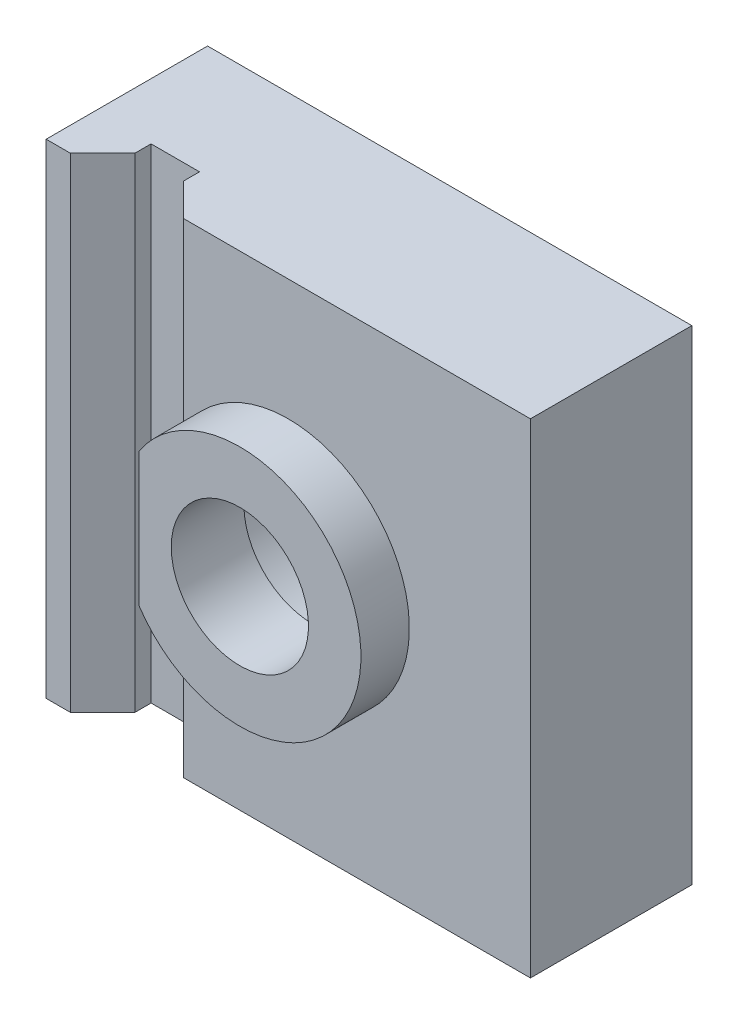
ISO-10303-21;
HEADER;
FILE_DESCRIPTION(('STEP AP214'),'2;1');
FILE_NAME('part.step','',(''),(''),'','','');
FILE_SCHEMA(('AUTOMOTIVE_DESIGN { 1 0 10303 214 1 1 1 1 }'));
ENDSEC;
DATA;
#1=APPLICATION_CONTEXT('core data for automotive mechanical design processes');
#2=APPLICATION_PROTOCOL_DEFINITION('international standard','automotive_design',2000,#1);
#3=PRODUCT_CONTEXT('',#1,'mechanical');
#4=PRODUCT('Part','Part','',(#3));
#5=PRODUCT_RELATED_PRODUCT_CATEGORY('part','',(#4));
#6=PRODUCT_DEFINITION_FORMATION('','',#4);
#7=PRODUCT_DEFINITION_CONTEXT('part definition',#1,'design');
#8=PRODUCT_DEFINITION('design','',#6,#7);
#9=PRODUCT_DEFINITION_SHAPE('','',#8);
#10=(LENGTH_UNIT() NAMED_UNIT(*) SI_UNIT(.MILLI.,.METRE.));
#11=(NAMED_UNIT(*) PLANE_ANGLE_UNIT() SI_UNIT($,.RADIAN.));
#12=(NAMED_UNIT(*) SI_UNIT($,.STERADIAN.) SOLID_ANGLE_UNIT());
#13=UNCERTAINTY_MEASURE_WITH_UNIT(LENGTH_MEASURE(1.E-05),#10,'distance_accuracy_value','');
#14=(GEOMETRIC_REPRESENTATION_CONTEXT(3) GLOBAL_UNCERTAINTY_ASSIGNED_CONTEXT((#13)) GLOBAL_UNIT_ASSIGNED_CONTEXT((#10,
#11,#12)) REPRESENTATION_CONTEXT('',''));
#15=CARTESIAN_POINT('',(0.,0.,0.));
#16=DIRECTION('',(0.,0.,1.));
#17=DIRECTION('',(1.,0.,0.));
#18=AXIS2_PLACEMENT_3D('',#15,#16,#17);
#19=CARTESIAN_POINT('',(0.,0.,10.));
#20=DIRECTION('',(0.,0.,1.));
#21=DIRECTION('',(1.,0.,0.));
#22=AXIS2_PLACEMENT_3D('',#19,#20,#21);
#23=PLANE('',#22);
#24=DIRECTION('',(0.,1.,0.));
#25=VECTOR('',#24,1.);
#26=CARTESIAN_POINT('',(-13.5,-15.,10.));
#27=LINE('',#26,#25);
#28=CARTESIAN_POINT('',(-13.5,-15.,10.));
#29=VERTEX_POINT('',#28);
#30=CARTESIAN_POINT('',(-13.5,15.,10.));
#31=VERTEX_POINT('',#30);
#32=EDGE_CURVE('E210',#29,#31,#27,.T.);
#33=ORIENTED_EDGE('',*,*,#32,.T.);
#34=DIRECTION('',(-1.,0.,0.));
#35=VECTOR('',#34,1.);
#36=CARTESIAN_POINT('',(-15.,15.,10.));
#37=LINE('',#36,#35);
#38=CARTESIAN_POINT('',(-15.,15.,10.));
#39=VERTEX_POINT('',#38);
#40=EDGE_CURVE('E185',#31,#39,#37,.T.);
#41=ORIENTED_EDGE('',*,*,#40,.T.);
#42=DIRECTION('',(0.,-1.,0.));
#43=VECTOR('',#42,1.);
#44=CARTESIAN_POINT('',(-15.,15.,10.));
#45=LINE('',#44,#43);
#46=CARTESIAN_POINT('',(-15.,-15.,10.));
#47=VERTEX_POINT('',#46);
#48=EDGE_CURVE('E149',#39,#47,#45,.T.);
#49=ORIENTED_EDGE('',*,*,#48,.T.);
#50=DIRECTION('',(1.,0.,0.));
#51=VECTOR('',#50,1.);
#52=CARTESIAN_POINT('',(-15.,-15.,10.));
#53=LINE('',#52,#51);
#54=EDGE_CURVE('E148',#47,#29,#53,.T.);
#55=ORIENTED_EDGE('',*,*,#54,.T.);
#56=EDGE_LOOP('',(#33,#41,#49,#55));
#57=FACE_BOUND('',#56,.T.);
#58=ADVANCED_FACE('F32',(#57),#23,.T.);
#59=DIRECTION('',(0.,1.,0.));
#60=VECTOR('',#59,1.);
#61=CARTESIAN_POINT('',(-6.5,-15.,10.));
#62=LINE('',#61,#60);
#63=CARTESIAN_POINT('',(-6.5,-15.,10.));
#64=VERTEX_POINT('',#63);
#65=CARTESIAN_POINT('',(-6.5,15.,10.));
#66=VERTEX_POINT('',#65);
#67=EDGE_CURVE('E126',#64,#66,#62,.T.);
#68=ORIENTED_EDGE('',*,*,#67,.F.);
#69=CARTESIAN_POINT('',(15.,-15.,10.));
#70=VERTEX_POINT('',#69);
#71=EDGE_CURVE('E138',#64,#70,#53,.T.);
#72=ORIENTED_EDGE('',*,*,#71,.T.);
#73=DIRECTION('',(0.,1.,0.));
#74=VECTOR('',#73,1.);
#75=CARTESIAN_POINT('',(15.,15.,10.));
#76=LINE('',#75,#74);
#77=CARTESIAN_POINT('',(15.,15.,10.));
#78=VERTEX_POINT('',#77);
#79=EDGE_CURVE('E165',#70,#78,#76,.T.);
#80=ORIENTED_EDGE('',*,*,#79,.T.);
#81=EDGE_CURVE('E140',#78,#66,#37,.T.);
#82=ORIENTED_EDGE('',*,*,#81,.T.);
#83=EDGE_LOOP('',(#68,#72,#80,#82));
#84=FACE_BOUND('',#83,.T.);
#85=DIRECTION('',(0.,-1.,0.));
#86=VECTOR('',#85,1.);
#87=CARTESIAN_POINT('',(-6.25,-4.14578098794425,10.));
#88=LINE('',#87,#86);
#89=CARTESIAN_POINT('',(-6.25,4.14578098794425,10.));
#90=VERTEX_POINT('',#89);
#91=CARTESIAN_POINT('',(-6.25,-4.14578098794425,10.));
#92=VERTEX_POINT('',#91);
#93=EDGE_CURVE('E192',#90,#92,#88,.T.);
#94=ORIENTED_EDGE('',*,*,#93,.F.);
#95=CARTESIAN_POINT('',(0.,0.,10.));
#96=DIRECTION('',(0.,0.,1.));
#97=DIRECTION('',(1.,0.,0.));
#98=AXIS2_PLACEMENT_3D('',#95,#96,#97);
#99=CIRCLE('',#98,7.5);
#100=EDGE_CURVE('E55',#92,#90,#99,.T.);
#101=ORIENTED_EDGE('',*,*,#100,.F.);
#102=EDGE_LOOP('',(#94,#101));
#103=FACE_BOUND('',#102,.T.);
#104=ADVANCED_FACE('F135',(#84,#103),#23,.T.);
#105=CARTESIAN_POINT('',(15.,15.,10.));
#106=DIRECTION('',(-1.,0.,0.));
#107=DIRECTION('',(0.,-1.,0.));
#108=AXIS2_PLACEMENT_3D('',#105,#106,#107);
#109=PLANE('',#108);
#110=DIRECTION('',(0.,1.,0.));
#111=VECTOR('',#110,1.);
#112=CARTESIAN_POINT('',(15.,15.,0.));
#113=LINE('',#112,#111);
#114=CARTESIAN_POINT('',(15.,-15.,0.));
#115=VERTEX_POINT('',#114);
#116=CARTESIAN_POINT('',(15.,15.,0.));
#117=VERTEX_POINT('',#116);
#118=EDGE_CURVE('E155',#115,#117,#113,.T.);
#119=ORIENTED_EDGE('',*,*,#118,.T.);
#120=DIRECTION('',(0.,0.,-1.));
#121=VECTOR('',#120,1.);
#122=CARTESIAN_POINT('',(15.,15.,10.));
#123=LINE('',#122,#121);
#124=EDGE_CURVE('E11',#78,#117,#123,.T.);
#125=ORIENTED_EDGE('',*,*,#124,.F.);
#126=ORIENTED_EDGE('',*,*,#79,.F.);
#127=DIRECTION('',(0.,0.,-1.));
#128=VECTOR('',#127,1.);
#129=CARTESIAN_POINT('',(15.,-15.,10.));
#130=LINE('',#129,#128);
#131=EDGE_CURVE('E146',#70,#115,#130,.T.);
#132=ORIENTED_EDGE('',*,*,#131,.T.);
#133=EDGE_LOOP('',(#119,#125,#126,#132));
#134=FACE_BOUND('',#133,.T.);
#135=ADVANCED_FACE('F34',(#134),#109,.F.);
#136=CARTESIAN_POINT('',(-15.,15.,10.));
#137=DIRECTION('',(0.,-1.,0.));
#138=DIRECTION('',(0.,0.,-1.));
#139=AXIS2_PLACEMENT_3D('',#136,#137,#138);
#140=PLANE('',#139);
#141=ORIENTED_EDGE('',*,*,#40,.F.);
#142=DIRECTION('',(-0.707106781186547,0.,0.707106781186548));
#143=VECTOR('',#142,1.);
#144=CARTESIAN_POINT('',(-13.5,15.,10.));
#145=LINE('',#144,#143);
#146=CARTESIAN_POINT('',(-11.5,15.,8.));
#147=VERTEX_POINT('',#146);
#148=EDGE_CURVE('E131',#147,#31,#145,.T.);
#149=ORIENTED_EDGE('',*,*,#148,.F.);
#150=DIRECTION('',(0.,0.,1.));
#151=VECTOR('',#150,1.);
#152=CARTESIAN_POINT('',(-11.5,15.,8.));
#153=LINE('',#152,#151);
#154=CARTESIAN_POINT('',(-11.5,15.,7.));
#155=VERTEX_POINT('',#154);
#156=EDGE_CURVE('E222',#155,#147,#153,.T.);
#157=ORIENTED_EDGE('',*,*,#156,.F.);
#158=DIRECTION('',(-1.,0.,0.));
#159=VECTOR('',#158,1.);
#160=CARTESIAN_POINT('',(-11.5,15.,7.));
#161=LINE('',#160,#159);
#162=CARTESIAN_POINT('',(-8.5,15.,7.));
#163=VERTEX_POINT('',#162);
#164=EDGE_CURVE('E225',#163,#155,#161,.T.);
#165=ORIENTED_EDGE('',*,*,#164,.F.);
#166=DIRECTION('',(0.,0.,-1.));
#167=VECTOR('',#166,1.);
#168=CARTESIAN_POINT('',(-8.5,15.,7.));
#169=LINE('',#168,#167);
#170=CARTESIAN_POINT('',(-8.5,15.,8.));
#171=VERTEX_POINT('',#170);
#172=EDGE_CURVE('E228',#171,#163,#169,.T.);
#173=ORIENTED_EDGE('',*,*,#172,.F.);
#174=DIRECTION('',(-0.707106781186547,0.,-0.707106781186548));
#175=VECTOR('',#174,1.);
#176=CARTESIAN_POINT('',(-8.5,15.,8.));
#177=LINE('',#176,#175);
#178=EDGE_CURVE('E231',#66,#171,#177,.T.);
#179=ORIENTED_EDGE('',*,*,#178,.F.);
#180=ORIENTED_EDGE('',*,*,#81,.F.);
#181=ORIENTED_EDGE('',*,*,#124,.T.);
#182=DIRECTION('',(-1.,0.,0.));
#183=VECTOR('',#182,1.);
#184=CARTESIAN_POINT('',(-15.,15.,0.));
#185=LINE('',#184,#183);
#186=CARTESIAN_POINT('',(-15.,15.,0.));
#187=VERTEX_POINT('',#186);
#188=EDGE_CURVE('E158',#117,#187,#185,.T.);
#189=ORIENTED_EDGE('',*,*,#188,.T.);
#190=DIRECTION('',(0.,0.,-1.));
#191=VECTOR('',#190,1.);
#192=CARTESIAN_POINT('',(-15.,15.,10.));
#193=LINE('',#192,#191);
#194=EDGE_CURVE('E40',#39,#187,#193,.T.);
#195=ORIENTED_EDGE('',*,*,#194,.F.);
#196=EDGE_LOOP('',(#141,#149,#157,#165,#173,#179,#180,#181,#189,#195));
#197=FACE_BOUND('',#196,.T.);
#198=ADVANCED_FACE('F253',(#197),#140,.F.);
#199=CARTESIAN_POINT('',(-15.,15.,10.));
#200=DIRECTION('',(1.,0.,0.));
#201=DIRECTION('',(0.,1.,0.));
#202=AXIS2_PLACEMENT_3D('',#199,#200,#201);
#203=PLANE('',#202);
#204=DIRECTION('',(0.,-1.,0.));
#205=VECTOR('',#204,1.);
#206=CARTESIAN_POINT('',(-15.,15.,0.));
#207=LINE('',#206,#205);
#208=CARTESIAN_POINT('',(-15.,-15.,0.));
#209=VERTEX_POINT('',#208);
#210=EDGE_CURVE('E161',#187,#209,#207,.T.);
#211=ORIENTED_EDGE('',*,*,#210,.T.);
#212=DIRECTION('',(0.,0.,-1.));
#213=VECTOR('',#212,1.);
#214=CARTESIAN_POINT('',(-15.,-15.,10.));
#215=LINE('',#214,#213);
#216=EDGE_CURVE('E167',#47,#209,#215,.T.);
#217=ORIENTED_EDGE('',*,*,#216,.F.);
#218=ORIENTED_EDGE('',*,*,#48,.F.);
#219=ORIENTED_EDGE('',*,*,#194,.T.);
#220=EDGE_LOOP('',(#211,#217,#218,#219));
#221=FACE_BOUND('',#220,.T.);
#222=ADVANCED_FACE('F174',(#221),#203,.F.);
#223=CARTESIAN_POINT('',(-15.,-15.,10.));
#224=DIRECTION('',(0.,1.,0.));
#225=DIRECTION('',(0.,0.,1.));
#226=AXIS2_PLACEMENT_3D('',#223,#224,#225);
#227=PLANE('',#226);
#228=DIRECTION('',(0.,0.,1.));
#229=VECTOR('',#228,1.);
#230=CARTESIAN_POINT('',(-11.5,-15.,8.));
#231=LINE('',#230,#229);
#232=CARTESIAN_POINT('',(-11.5,-15.,7.));
#233=VERTEX_POINT('',#232);
#234=CARTESIAN_POINT('',(-11.5,-15.,8.));
#235=VERTEX_POINT('',#234);
#236=EDGE_CURVE('E235',#233,#235,#231,.T.);
#237=ORIENTED_EDGE('',*,*,#236,.T.);
#238=DIRECTION('',(-0.707106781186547,0.,0.707106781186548));
#239=VECTOR('',#238,1.);
#240=CARTESIAN_POINT('',(-13.5,-15.,10.));
#241=LINE('',#240,#239);
#242=EDGE_CURVE('E141',#235,#29,#241,.T.);
#243=ORIENTED_EDGE('',*,*,#242,.T.);
#244=ORIENTED_EDGE('',*,*,#54,.F.);
#245=ORIENTED_EDGE('',*,*,#216,.T.);
#246=DIRECTION('',(1.,0.,0.));
#247=VECTOR('',#246,1.);
#248=CARTESIAN_POINT('',(-15.,-15.,0.));
#249=LINE('',#248,#247);
#250=EDGE_CURVE('E163',#209,#115,#249,.T.);
#251=ORIENTED_EDGE('',*,*,#250,.T.);
#252=ORIENTED_EDGE('',*,*,#131,.F.);
#253=ORIENTED_EDGE('',*,*,#71,.F.);
#254=DIRECTION('',(-0.707106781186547,0.,-0.707106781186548));
#255=VECTOR('',#254,1.);
#256=CARTESIAN_POINT('',(-8.5,-15.,8.));
#257=LINE('',#256,#255);
#258=CARTESIAN_POINT('',(-8.5,-15.,8.));
#259=VERTEX_POINT('',#258);
#260=EDGE_CURVE('E122',#64,#259,#257,.T.);
#261=ORIENTED_EDGE('',*,*,#260,.T.);
#262=DIRECTION('',(0.,0.,-1.));
#263=VECTOR('',#262,1.);
#264=CARTESIAN_POINT('',(-8.5,-15.,7.));
#265=LINE('',#264,#263);
#266=CARTESIAN_POINT('',(-8.5,-15.,7.));
#267=VERTEX_POINT('',#266);
#268=EDGE_CURVE('E47',#259,#267,#265,.T.);
#269=ORIENTED_EDGE('',*,*,#268,.T.);
#270=DIRECTION('',(-1.,0.,0.));
#271=VECTOR('',#270,1.);
#272=CARTESIAN_POINT('',(-11.5,-15.,7.));
#273=LINE('',#272,#271);
#274=EDGE_CURVE('E237',#267,#233,#273,.T.);
#275=ORIENTED_EDGE('',*,*,#274,.T.);
#276=EDGE_LOOP('',(#237,#243,#244,#245,#251,#252,#253,#261,#269,#275));
#277=FACE_BOUND('',#276,.T.);
#278=ADVANCED_FACE('F144',(#277),#227,.F.);
#279=CARTESIAN_POINT('',(0.,0.,0.));
#280=DIRECTION('',(0.,0.,1.));
#281=DIRECTION('',(1.,0.,0.));
#282=AXIS2_PLACEMENT_3D('',#279,#280,#281);
#283=PLANE('',#282);
#284=CARTESIAN_POINT('',(0.,0.,0.));
#285=DIRECTION('',(0.,0.,-1.));
#286=DIRECTION('',(-1.,0.,0.));
#287=AXIS2_PLACEMENT_3D('',#284,#285,#286);
#288=CIRCLE('',#287,6.75);
#289=CARTESIAN_POINT('',(-6.75,0.,0.));
#290=VERTEX_POINT('',#289);
#291=EDGE_CURVE('E208',#290,#290,#288,.T.);
#292=ORIENTED_EDGE('',*,*,#291,.F.);
#293=EDGE_LOOP('',(#292));
#294=FACE_BOUND('',#293,.T.);
#295=ORIENTED_EDGE('',*,*,#118,.F.);
#296=ORIENTED_EDGE('',*,*,#250,.F.);
#297=ORIENTED_EDGE('',*,*,#210,.F.);
#298=ORIENTED_EDGE('',*,*,#188,.F.);
#299=EDGE_LOOP('',(#295,#296,#297,#298));
#300=FACE_BOUND('',#299,.T.);
#301=ADVANCED_FACE('F181',(#294,#300),#283,.F.);
#302=CARTESIAN_POINT('',(0.,0.,13.));
#303=DIRECTION('',(0.,0.,-1.));
#304=DIRECTION('',(-1.,0.,0.));
#305=AXIS2_PLACEMENT_3D('',#302,#303,#304);
#306=CYLINDRICAL_SURFACE('',#305,7.5);
#307=ORIENTED_EDGE('',*,*,#100,.T.);
#308=DIRECTION('',(0.,0.,-1.));
#309=VECTOR('',#308,1.);
#310=CARTESIAN_POINT('',(-6.25,4.14578098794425,13.));
#311=LINE('',#310,#309);
#312=CARTESIAN_POINT('',(-6.25,4.14578098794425,13.));
#313=VERTEX_POINT('',#312);
#314=EDGE_CURVE('E159',#313,#90,#311,.T.);
#315=ORIENTED_EDGE('',*,*,#314,.F.);
#316=CARTESIAN_POINT('',(0.,0.,13.));
#317=DIRECTION('',(0.,0.,1.));
#318=DIRECTION('',(1.,0.,0.));
#319=AXIS2_PLACEMENT_3D('',#316,#317,#318);
#320=CIRCLE('',#319,7.5);
#321=CARTESIAN_POINT('',(-6.25,-4.14578098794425,13.));
#322=VERTEX_POINT('',#321);
#323=EDGE_CURVE('E194',#322,#313,#320,.T.);
#324=ORIENTED_EDGE('',*,*,#323,.F.);
#325=DIRECTION('',(0.,0.,-1.));
#326=VECTOR('',#325,1.);
#327=CARTESIAN_POINT('',(-6.25,-4.14578098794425,13.));
#328=LINE('',#327,#326);
#329=EDGE_CURVE('E189',#322,#92,#328,.T.);
#330=ORIENTED_EDGE('',*,*,#329,.T.);
#331=EDGE_LOOP('',(#307,#315,#324,#330));
#332=FACE_BOUND('',#331,.T.);
#333=ADVANCED_FACE('F271',(#332),#306,.T.);
#334=CARTESIAN_POINT('',(-6.25,-4.14578098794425,13.));
#335=DIRECTION('',(1.,0.,0.));
#336=DIRECTION('',(0.,0.,-1.));
#337=AXIS2_PLACEMENT_3D('',#334,#335,#336);
#338=PLANE('',#337);
#339=ORIENTED_EDGE('',*,*,#93,.T.);
#340=ORIENTED_EDGE('',*,*,#329,.F.);
#341=DIRECTION('',(0.,-1.,0.));
#342=VECTOR('',#341,1.);
#343=CARTESIAN_POINT('',(-6.25,-4.14578098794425,13.));
#344=LINE('',#343,#342);
#345=EDGE_CURVE('E191',#313,#322,#344,.T.);
#346=ORIENTED_EDGE('',*,*,#345,.F.);
#347=ORIENTED_EDGE('',*,*,#314,.T.);
#348=EDGE_LOOP('',(#339,#340,#346,#347));
#349=FACE_BOUND('',#348,.T.);
#350=ADVANCED_FACE('F370',(#349),#338,.F.);
#351=CARTESIAN_POINT('',(0.,0.,13.));
#352=DIRECTION('',(0.,0.,1.));
#353=DIRECTION('',(1.,0.,0.));
#354=AXIS2_PLACEMENT_3D('',#351,#352,#353);
#355=PLANE('',#354);
#356=CARTESIAN_POINT('',(0.,0.,13.));
#357=DIRECTION('',(0.,0.,-1.));
#358=DIRECTION('',(-1.,0.,0.));
#359=AXIS2_PLACEMENT_3D('',#356,#357,#358);
#360=CIRCLE('',#359,4.25);
#361=CARTESIAN_POINT('',(-4.25,0.,13.));
#362=VERTEX_POINT('',#361);
#363=EDGE_CURVE('E196',#362,#362,#360,.T.);
#364=ORIENTED_EDGE('',*,*,#363,.T.);
#365=EDGE_LOOP('',(#364));
#366=FACE_BOUND('',#365,.T.);
#367=ORIENTED_EDGE('',*,*,#323,.T.);
#368=ORIENTED_EDGE('',*,*,#345,.T.);
#369=EDGE_LOOP('',(#367,#368));
#370=FACE_BOUND('',#369,.T.);
#371=ADVANCED_FACE('F362',(#366,#370),#355,.T.);
#372=CARTESIAN_POINT('',(0.,0.,0.));
#373=DIRECTION('',(0.,0.,-1.));
#374=DIRECTION('',(-1.,0.,0.));
#375=AXIS2_PLACEMENT_3D('',#372,#373,#374);
#376=CYLINDRICAL_SURFACE('',#375,4.25);
#377=ORIENTED_EDGE('',*,*,#363,.F.);
#378=EDGE_LOOP('',(#377));
#379=FACE_BOUND('',#378,.T.);
#380=CARTESIAN_POINT('',(0.,0.,8.5));
#381=DIRECTION('',(0.,0.,-1.));
#382=DIRECTION('',(-1.,0.,0.));
#383=AXIS2_PLACEMENT_3D('',#380,#381,#382);
#384=CIRCLE('',#383,4.25);
#385=CARTESIAN_POINT('',(-4.25,0.,8.5));
#386=VERTEX_POINT('',#385);
#387=EDGE_CURVE('E202',#386,#386,#384,.T.);
#388=ORIENTED_EDGE('',*,*,#387,.T.);
#389=EDGE_LOOP('',(#388));
#390=FACE_BOUND('',#389,.T.);
#391=ADVANCED_FACE('F354',(#379,#390),#376,.F.);
#392=CARTESIAN_POINT('',(4.25,0.,8.5));
#393=DIRECTION('',(0.,0.,1.));
#394=DIRECTION('',(1.,0.,0.));
#395=AXIS2_PLACEMENT_3D('',#392,#393,#394);
#396=PLANE('',#395);
#397=ORIENTED_EDGE('',*,*,#387,.F.);
#398=EDGE_LOOP('',(#397));
#399=FACE_BOUND('',#398,.T.);
#400=CARTESIAN_POINT('',(0.,0.,8.5));
#401=DIRECTION('',(0.,0.,-1.));
#402=DIRECTION('',(-1.,0.,0.));
#403=AXIS2_PLACEMENT_3D('',#400,#401,#402);
#404=CIRCLE('',#403,6.75);
#405=CARTESIAN_POINT('',(-6.75,0.,8.5));
#406=VERTEX_POINT('',#405);
#407=EDGE_CURVE('E205',#406,#406,#404,.T.);
#408=ORIENTED_EDGE('',*,*,#407,.T.);
#409=EDGE_LOOP('',(#408));
#410=FACE_BOUND('',#409,.T.);
#411=ADVANCED_FACE('F346',(#399,#410),#396,.F.);
#412=CARTESIAN_POINT('',(0.,0.,0.));
#413=DIRECTION('',(0.,0.,-1.));
#414=DIRECTION('',(-1.,0.,0.));
#415=AXIS2_PLACEMENT_3D('',#412,#413,#414);
#416=CYLINDRICAL_SURFACE('',#415,6.75);
#417=ORIENTED_EDGE('',*,*,#407,.F.);
#418=EDGE_LOOP('',(#417));
#419=FACE_BOUND('',#418,.T.);
#420=ORIENTED_EDGE('',*,*,#291,.T.);
#421=EDGE_LOOP('',(#420));
#422=FACE_BOUND('',#421,.T.);
#423=ADVANCED_FACE('F315',(#419,#422),#416,.F.);
#424=CARTESIAN_POINT('',(-13.5,-15.,10.));
#425=DIRECTION('',(-0.707106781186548,0.,-0.707106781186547));
#426=DIRECTION('',(-0.707106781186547,0.,0.707106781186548));
#427=AXIS2_PLACEMENT_3D('',#424,#425,#426);
#428=PLANE('',#427);
#429=ORIENTED_EDGE('',*,*,#148,.T.);
#430=ORIENTED_EDGE('',*,*,#32,.F.);
#431=ORIENTED_EDGE('',*,*,#242,.F.);
#432=DIRECTION('',(0.,1.,0.));
#433=VECTOR('',#432,1.);
#434=CARTESIAN_POINT('',(-11.5,-15.,8.));
#435=LINE('',#434,#433);
#436=EDGE_CURVE('E217',#235,#147,#435,.T.);
#437=ORIENTED_EDGE('',*,*,#436,.T.);
#438=EDGE_LOOP('',(#429,#430,#431,#437));
#439=FACE_BOUND('',#438,.T.);
#440=ADVANCED_FACE('F251',(#439),#428,.F.);
#441=CARTESIAN_POINT('',(-11.5,-15.,8.));
#442=DIRECTION('',(-1.,0.,0.));
#443=DIRECTION('',(0.,0.,1.));
#444=AXIS2_PLACEMENT_3D('',#441,#442,#443);
#445=PLANE('',#444);
#446=ORIENTED_EDGE('',*,*,#156,.T.);
#447=ORIENTED_EDGE('',*,*,#436,.F.);
#448=ORIENTED_EDGE('',*,*,#236,.F.);
#449=DIRECTION('',(0.,1.,0.));
#450=VECTOR('',#449,1.);
#451=CARTESIAN_POINT('',(-11.5,-15.,7.));
#452=LINE('',#451,#450);
#453=EDGE_CURVE('E215',#233,#155,#452,.T.);
#454=ORIENTED_EDGE('',*,*,#453,.T.);
#455=EDGE_LOOP('',(#446,#447,#448,#454));
#456=FACE_BOUND('',#455,.T.);
#457=ADVANCED_FACE('F247',(#456),#445,.F.);
#458=CARTESIAN_POINT('',(-11.5,-15.,7.));
#459=DIRECTION('',(0.,0.,-1.));
#460=DIRECTION('',(-1.,0.,0.));
#461=AXIS2_PLACEMENT_3D('',#458,#459,#460);
#462=PLANE('',#461);
#463=ORIENTED_EDGE('',*,*,#164,.T.);
#464=ORIENTED_EDGE('',*,*,#453,.F.);
#465=ORIENTED_EDGE('',*,*,#274,.F.);
#466=DIRECTION('',(0.,1.,0.));
#467=VECTOR('',#466,1.);
#468=CARTESIAN_POINT('',(-8.5,-15.,7.));
#469=LINE('',#468,#467);
#470=EDGE_CURVE('E213',#267,#163,#469,.T.);
#471=ORIENTED_EDGE('',*,*,#470,.T.);
#472=EDGE_LOOP('',(#463,#464,#465,#471));
#473=FACE_BOUND('',#472,.T.);
#474=ADVANCED_FACE('F243',(#473),#462,.F.);
#475=CARTESIAN_POINT('',(-8.5,-15.,7.));
#476=DIRECTION('',(1.,0.,0.));
#477=DIRECTION('',(0.,0.,-1.));
#478=AXIS2_PLACEMENT_3D('',#475,#476,#477);
#479=PLANE('',#478);
#480=ORIENTED_EDGE('',*,*,#172,.T.);
#481=ORIENTED_EDGE('',*,*,#470,.F.);
#482=ORIENTED_EDGE('',*,*,#268,.F.);
#483=DIRECTION('',(0.,1.,0.));
#484=VECTOR('',#483,1.);
#485=CARTESIAN_POINT('',(-8.5,-15.,8.));
#486=LINE('',#485,#484);
#487=EDGE_CURVE('E128',#259,#171,#486,.T.);
#488=ORIENTED_EDGE('',*,*,#487,.T.);
#489=EDGE_LOOP('',(#480,#481,#482,#488));
#490=FACE_BOUND('',#489,.T.);
#491=ADVANCED_FACE('F255',(#490),#479,.F.);
#492=CARTESIAN_POINT('',(-8.5,-15.,8.));
#493=DIRECTION('',(0.707106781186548,0.,-0.707106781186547));
#494=DIRECTION('',(-0.707106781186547,0.,-0.707106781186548));
#495=AXIS2_PLACEMENT_3D('',#492,#493,#494);
#496=PLANE('',#495);
#497=ORIENTED_EDGE('',*,*,#178,.T.);
#498=ORIENTED_EDGE('',*,*,#487,.F.);
#499=ORIENTED_EDGE('',*,*,#260,.F.);
#500=ORIENTED_EDGE('',*,*,#67,.T.);
#501=EDGE_LOOP('',(#497,#498,#499,#500));
#502=FACE_BOUND('',#501,.T.);
#503=ADVANCED_FACE('F125',(#502),#496,.F.);
#504=CLOSED_SHELL('',(#58,#104,#135,#198,#222,#278,#301,#333,#350,#371,#391,#411,#423,#440,#457,
#474,#491,#503));
#505=MANIFOLD_SOLID_BREP('B2',#504);
#506=ADVANCED_BREP_SHAPE_REPRESENTATION('',(#18,#505),#14);
#507=SHAPE_DEFINITION_REPRESENTATION(#9,#506);
ENDSEC;
END-ISO-10303-21;
